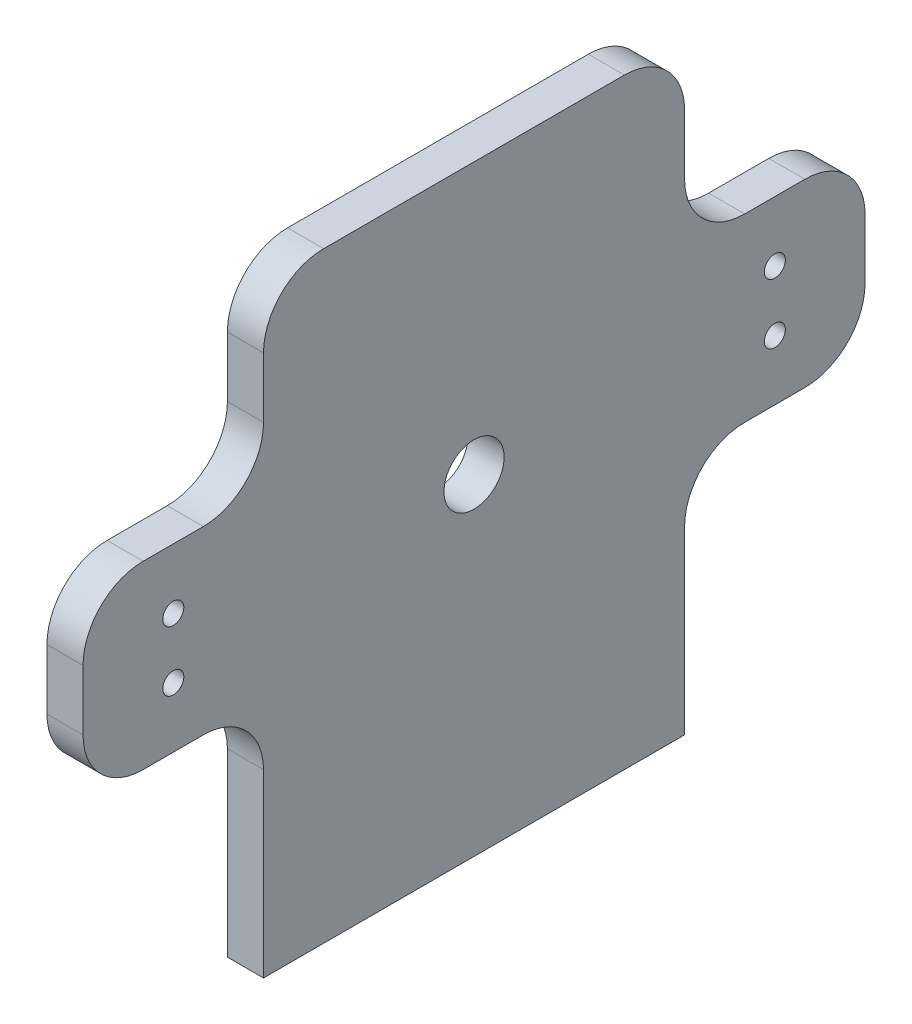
ISO-10303-21;
HEADER;
FILE_DESCRIPTION(('STEP AP214'),'2;1');
FILE_NAME('part.step','',(''),(''),'','','');
FILE_SCHEMA(('AUTOMOTIVE_DESIGN { 1 0 10303 214 1 1 1 1 }'));
ENDSEC;
DATA;
#1=APPLICATION_CONTEXT('core data for automotive mechanical design processes');
#2=APPLICATION_PROTOCOL_DEFINITION('international standard','automotive_design',2000,#1);
#3=PRODUCT_CONTEXT('',#1,'mechanical');
#4=PRODUCT('Part','Part','',(#3));
#5=PRODUCT_RELATED_PRODUCT_CATEGORY('part','',(#4));
#6=PRODUCT_DEFINITION_FORMATION('','',#4);
#7=PRODUCT_DEFINITION_CONTEXT('part definition',#1,'design');
#8=PRODUCT_DEFINITION('design','',#6,#7);
#9=PRODUCT_DEFINITION_SHAPE('','',#8);
#10=(LENGTH_UNIT() NAMED_UNIT(*) SI_UNIT(.MILLI.,.METRE.));
#11=(NAMED_UNIT(*) PLANE_ANGLE_UNIT() SI_UNIT($,.RADIAN.));
#12=(NAMED_UNIT(*) SI_UNIT($,.STERADIAN.) SOLID_ANGLE_UNIT());
#13=UNCERTAINTY_MEASURE_WITH_UNIT(LENGTH_MEASURE(1.E-05),#10,'distance_accuracy_value','');
#14=(GEOMETRIC_REPRESENTATION_CONTEXT(3) GLOBAL_UNCERTAINTY_ASSIGNED_CONTEXT((#13)) GLOBAL_UNIT_ASSIGNED_CONTEXT((#10,
#11,#12)) REPRESENTATION_CONTEXT('',''));
#15=CARTESIAN_POINT('',(0.,0.,0.));
#16=DIRECTION('',(0.,0.,1.));
#17=DIRECTION('',(1.,0.,0.));
#18=AXIS2_PLACEMENT_3D('',#15,#16,#17);
#19=CARTESIAN_POINT('',(6.,0.,0.));
#20=DIRECTION('',(0.,0.,-1.));
#21=DIRECTION('',(-1.,0.,0.));
#22=AXIS2_PLACEMENT_3D('',#19,#20,#21);
#23=PLANE('',#22);
#24=DIRECTION('',(0.,-1.,0.));
#25=VECTOR('',#24,1.);
#26=CARTESIAN_POINT('',(6.,0.,0.));
#27=LINE('',#26,#25);
#28=CARTESIAN_POINT('',(6.,30.,0.));
#29=VERTEX_POINT('',#28);
#30=CARTESIAN_POINT('',(6.,0.,0.));
#31=VERTEX_POINT('',#30);
#32=EDGE_CURVE('E214',#29,#31,#27,.T.);
#33=ORIENTED_EDGE('',*,*,#32,.F.);
#34=DIRECTION('',(-1.,0.,0.));
#35=VECTOR('',#34,1.);
#36=CARTESIAN_POINT('',(0.,30.,0.));
#37=LINE('',#36,#35);
#38=CARTESIAN_POINT('',(0.,30.,0.));
#39=VERTEX_POINT('',#38);
#40=EDGE_CURVE('E291',#29,#39,#37,.T.);
#41=ORIENTED_EDGE('',*,*,#40,.T.);
#42=DIRECTION('',(0.,-1.,0.));
#43=VECTOR('',#42,1.);
#44=CARTESIAN_POINT('',(0.,0.,0.));
#45=LINE('',#44,#43);
#46=CARTESIAN_POINT('',(0.,0.,0.));
#47=VERTEX_POINT('',#46);
#48=EDGE_CURVE('E213',#39,#47,#45,.T.);
#49=ORIENTED_EDGE('',*,*,#48,.T.);
#50=DIRECTION('',(-1.,0.,0.));
#51=VECTOR('',#50,1.);
#52=CARTESIAN_POINT('',(6.,0.,0.));
#53=LINE('',#52,#51);
#54=EDGE_CURVE('E281',#31,#47,#53,.T.);
#55=ORIENTED_EDGE('',*,*,#54,.F.);
#56=EDGE_LOOP('',(#33,#41,#49,#55));
#57=FACE_BOUND('',#56,.T.);
#58=ADVANCED_FACE('F30',(#57),#23,.F.);
#59=CARTESIAN_POINT('',(6.,0.,0.));
#60=DIRECTION('',(0.,1.,0.));
#61=DIRECTION('',(0.,0.,1.));
#62=AXIS2_PLACEMENT_3D('',#59,#60,#61);
#63=PLANE('',#62);
#64=CARTESIAN_POINT('',(3.,0.,-20.));
#65=DIRECTION('',(0.,-1.,0.));
#66=DIRECTION('',(0.,0.,-1.));
#67=AXIS2_PLACEMENT_3D('',#64,#65,#66);
#68=CIRCLE('',#67,1.5);
#69=CARTESIAN_POINT('',(3.,0.,-21.5));
#70=VERTEX_POINT('',#69);
#71=EDGE_CURVE('E785',#70,#70,#68,.T.);
#72=ORIENTED_EDGE('',*,*,#71,.F.);
#73=EDGE_LOOP('',(#72));
#74=FACE_BOUND('',#73,.T.);
#75=CARTESIAN_POINT('',(3.00000000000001,0.,-50.));
#76=DIRECTION('',(0.,-1.,0.));
#77=DIRECTION('',(0.,0.,-1.));
#78=AXIS2_PLACEMENT_3D('',#75,#76,#77);
#79=CIRCLE('',#78,1.5);
#80=CARTESIAN_POINT('',(3.00000000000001,0.,-51.5));
#81=VERTEX_POINT('',#80);
#82=EDGE_CURVE('E194',#81,#81,#79,.T.);
#83=ORIENTED_EDGE('',*,*,#82,.F.);
#84=EDGE_LOOP('',(#83));
#85=FACE_BOUND('',#84,.T.);
#86=DIRECTION('',(0.,0.,-1.));
#87=VECTOR('',#86,1.);
#88=CARTESIAN_POINT('',(0.,0.,0.));
#89=LINE('',#88,#87);
#90=CARTESIAN_POINT('',(0.,0.,-70.));
#91=VERTEX_POINT('',#90);
#92=EDGE_CURVE('E249',#47,#91,#89,.T.);
#93=ORIENTED_EDGE('',*,*,#92,.T.);
#94=DIRECTION('',(-1.,0.,0.));
#95=VECTOR('',#94,1.);
#96=CARTESIAN_POINT('',(6.,0.,-70.));
#97=LINE('',#96,#95);
#98=CARTESIAN_POINT('',(6.,0.,-70.));
#99=VERTEX_POINT('',#98);
#100=EDGE_CURVE('E247',#99,#91,#97,.T.);
#101=ORIENTED_EDGE('',*,*,#100,.F.);
#102=DIRECTION('',(0.,0.,-1.));
#103=VECTOR('',#102,1.);
#104=CARTESIAN_POINT('',(6.,0.,0.));
#105=LINE('',#104,#103);
#106=EDGE_CURVE('E216',#31,#99,#105,.T.);
#107=ORIENTED_EDGE('',*,*,#106,.F.);
#108=ORIENTED_EDGE('',*,*,#54,.T.);
#109=EDGE_LOOP('',(#93,#101,#107,#108));
#110=FACE_BOUND('',#109,.T.);
#111=ADVANCED_FACE('F413',(#74,#85,#110),#63,.F.);
#112=CARTESIAN_POINT('',(6.,0.,-70.));
#113=DIRECTION('',(0.,0.,1.));
#114=DIRECTION('',(1.,0.,0.));
#115=AXIS2_PLACEMENT_3D('',#112,#113,#114);
#116=PLANE('',#115);
#117=DIRECTION('',(0.,1.,0.));
#118=VECTOR('',#117,1.);
#119=CARTESIAN_POINT('',(0.,0.,-70.));
#120=LINE('',#119,#118);
#121=CARTESIAN_POINT('',(0.,30.,-70.));
#122=VERTEX_POINT('',#121);
#123=EDGE_CURVE('E251',#91,#122,#120,.T.);
#124=ORIENTED_EDGE('',*,*,#123,.T.);
#125=DIRECTION('',(-1.,0.,0.));
#126=VECTOR('',#125,1.);
#127=CARTESIAN_POINT('',(6.,30.,-70.));
#128=LINE('',#127,#126);
#129=CARTESIAN_POINT('',(6.,30.,-70.));
#130=VERTEX_POINT('',#129);
#131=EDGE_CURVE('E289',#122,#130,#128,.F.);
#132=ORIENTED_EDGE('',*,*,#131,.T.);
#133=DIRECTION('',(0.,1.,0.));
#134=VECTOR('',#133,1.);
#135=CARTESIAN_POINT('',(6.,0.,-70.));
#136=LINE('',#135,#134);
#137=EDGE_CURVE('E219',#99,#130,#136,.T.);
#138=ORIENTED_EDGE('',*,*,#137,.F.);
#139=ORIENTED_EDGE('',*,*,#100,.T.);
#140=EDGE_LOOP('',(#124,#132,#138,#139));
#141=FACE_BOUND('',#140,.T.);
#142=ADVANCED_FACE('F474',(#141),#116,.F.);
#143=CARTESIAN_POINT('',(6.,40.,-70.));
#144=DIRECTION('',(0.,1.,0.));
#145=DIRECTION('',(0.,0.,1.));
#146=AXIS2_PLACEMENT_3D('',#143,#144,#145);
#147=PLANE('',#146);
#148=DIRECTION('',(0.,0.,-1.));
#149=VECTOR('',#148,1.);
#150=CARTESIAN_POINT('',(6.,40.,-70.));
#151=LINE('',#150,#149);
#152=CARTESIAN_POINT('',(6.,40.,-80.));
#153=VERTEX_POINT('',#152);
#154=CARTESIAN_POINT('',(6.,40.,-90.));
#155=VERTEX_POINT('',#154);
#156=EDGE_CURVE('E222',#153,#155,#151,.T.);
#157=ORIENTED_EDGE('',*,*,#156,.F.);
#158=DIRECTION('',(-1.,0.,0.));
#159=VECTOR('',#158,1.);
#160=CARTESIAN_POINT('',(0.,40.,-80.));
#161=LINE('',#160,#159);
#162=CARTESIAN_POINT('',(0.,40.,-80.));
#163=VERTEX_POINT('',#162);
#164=EDGE_CURVE('E286',#153,#163,#161,.T.);
#165=ORIENTED_EDGE('',*,*,#164,.T.);
#166=DIRECTION('',(0.,0.,-1.));
#167=VECTOR('',#166,1.);
#168=CARTESIAN_POINT('',(0.,40.,-70.));
#169=LINE('',#168,#167);
#170=CARTESIAN_POINT('',(0.,40.,-90.));
#171=VERTEX_POINT('',#170);
#172=EDGE_CURVE('E254',#163,#171,#169,.T.);
#173=ORIENTED_EDGE('',*,*,#172,.T.);
#174=DIRECTION('',(-1.,0.,0.));
#175=VECTOR('',#174,1.);
#176=CARTESIAN_POINT('',(6.,40.,-90.));
#177=LINE('',#176,#175);
#178=EDGE_CURVE('E284',#171,#155,#177,.F.);
#179=ORIENTED_EDGE('',*,*,#178,.T.);
#180=EDGE_LOOP('',(#157,#165,#173,#179));
#181=FACE_BOUND('',#180,.T.);
#182=ADVANCED_FACE('F424',(#181),#147,.F.);
#183=CARTESIAN_POINT('',(6.,70.,-100.));
#184=DIRECTION('',(0.,0.,1.));
#185=DIRECTION('',(1.,0.,0.));
#186=AXIS2_PLACEMENT_3D('',#183,#184,#185);
#187=PLANE('',#186);
#188=DIRECTION('',(0.,1.,0.));
#189=VECTOR('',#188,1.);
#190=CARTESIAN_POINT('',(6.,70.,-100.));
#191=LINE('',#190,#189);
#192=CARTESIAN_POINT('',(6.,50.,-100.));
#193=VERTEX_POINT('',#192);
#194=CARTESIAN_POINT('',(6.,60.,-100.));
#195=VERTEX_POINT('',#194);
#196=EDGE_CURVE('E225',#193,#195,#191,.T.);
#197=ORIENTED_EDGE('',*,*,#196,.F.);
#198=DIRECTION('',(-1.,0.,0.));
#199=VECTOR('',#198,1.);
#200=CARTESIAN_POINT('',(6.,50.,-100.));
#201=LINE('',#200,#199);
#202=CARTESIAN_POINT('',(0.,50.,-100.));
#203=VERTEX_POINT('',#202);
#204=EDGE_CURVE('E321',#193,#203,#201,.T.);
#205=ORIENTED_EDGE('',*,*,#204,.T.);
#206=DIRECTION('',(0.,1.,0.));
#207=VECTOR('',#206,1.);
#208=CARTESIAN_POINT('',(0.,70.,-100.));
#209=LINE('',#208,#207);
#210=CARTESIAN_POINT('',(0.,60.,-100.));
#211=VERTEX_POINT('',#210);
#212=EDGE_CURVE('E257',#203,#211,#209,.T.);
#213=ORIENTED_EDGE('',*,*,#212,.T.);
#214=DIRECTION('',(-1.,0.,0.));
#215=VECTOR('',#214,1.);
#216=CARTESIAN_POINT('',(6.,60.,-100.));
#217=LINE('',#216,#215);
#218=EDGE_CURVE('E319',#211,#195,#217,.F.);
#219=ORIENTED_EDGE('',*,*,#218,.T.);
#220=EDGE_LOOP('',(#197,#205,#213,#219));
#221=FACE_BOUND('',#220,.T.);
#222=ADVANCED_FACE('F432',(#221),#187,.F.);
#223=CARTESIAN_POINT('',(6.,70.,-70.));
#224=DIRECTION('',(0.,-1.,0.));
#225=DIRECTION('',(0.,0.,-1.));
#226=AXIS2_PLACEMENT_3D('',#223,#224,#225);
#227=PLANE('',#226);
#228=DIRECTION('',(0.,0.,1.));
#229=VECTOR('',#228,1.);
#230=CARTESIAN_POINT('',(0.,70.,-70.));
#231=LINE('',#230,#229);
#232=CARTESIAN_POINT('',(0.,70.,-90.));
#233=VERTEX_POINT('',#232);
#234=CARTESIAN_POINT('',(0.,70.,-80.));
#235=VERTEX_POINT('',#234);
#236=EDGE_CURVE('E260',#233,#235,#231,.T.);
#237=ORIENTED_EDGE('',*,*,#236,.T.);
#238=DIRECTION('',(-1.,0.,0.));
#239=VECTOR('',#238,1.);
#240=CARTESIAN_POINT('',(6.,70.,-80.));
#241=LINE('',#240,#239);
#242=CARTESIAN_POINT('',(6.,70.,-80.));
#243=VERTEX_POINT('',#242);
#244=EDGE_CURVE('E307',#235,#243,#241,.F.);
#245=ORIENTED_EDGE('',*,*,#244,.T.);
#246=DIRECTION('',(0.,0.,1.));
#247=VECTOR('',#246,1.);
#248=CARTESIAN_POINT('',(6.,70.,-70.));
#249=LINE('',#248,#247);
#250=CARTESIAN_POINT('',(6.,70.,-90.));
#251=VERTEX_POINT('',#250);
#252=EDGE_CURVE('E228',#251,#243,#249,.T.);
#253=ORIENTED_EDGE('',*,*,#252,.F.);
#254=DIRECTION('',(-1.,0.,0.));
#255=VECTOR('',#254,1.);
#256=CARTESIAN_POINT('',(6.,70.,-90.));
#257=LINE('',#256,#255);
#258=EDGE_CURVE('E304',#251,#233,#257,.T.);
#259=ORIENTED_EDGE('',*,*,#258,.T.);
#260=EDGE_LOOP('',(#237,#245,#253,#259));
#261=FACE_BOUND('',#260,.T.);
#262=ADVANCED_FACE('F441',(#261),#227,.F.);
#263=CARTESIAN_POINT('',(6.,70.,-70.));
#264=DIRECTION('',(0.,0.,1.));
#265=DIRECTION('',(1.,0.,0.));
#266=AXIS2_PLACEMENT_3D('',#263,#264,#265);
#267=PLANE('',#266);
#268=DIRECTION('',(0.,1.,0.));
#269=VECTOR('',#268,1.);
#270=CARTESIAN_POINT('',(6.,70.,-70.));
#271=LINE('',#270,#269);
#272=CARTESIAN_POINT('',(6.,80.,-70.));
#273=VERTEX_POINT('',#272);
#274=CARTESIAN_POINT('',(6.,90.,-70.));
#275=VERTEX_POINT('',#274);
#276=EDGE_CURVE('E231',#273,#275,#271,.T.);
#277=ORIENTED_EDGE('',*,*,#276,.F.);
#278=DIRECTION('',(-1.,0.,0.));
#279=VECTOR('',#278,1.);
#280=CARTESIAN_POINT('',(0.,80.,-70.));
#281=LINE('',#280,#279);
#282=CARTESIAN_POINT('',(0.,80.,-70.));
#283=VERTEX_POINT('',#282);
#284=EDGE_CURVE('E301',#273,#283,#281,.T.);
#285=ORIENTED_EDGE('',*,*,#284,.T.);
#286=DIRECTION('',(0.,1.,0.));
#287=VECTOR('',#286,1.);
#288=CARTESIAN_POINT('',(0.,70.,-70.));
#289=LINE('',#288,#287);
#290=CARTESIAN_POINT('',(0.,90.,-70.));
#291=VERTEX_POINT('',#290);
#292=EDGE_CURVE('E263',#283,#291,#289,.T.);
#293=ORIENTED_EDGE('',*,*,#292,.T.);
#294=DIRECTION('',(-1.,0.,0.));
#295=VECTOR('',#294,1.);
#296=CARTESIAN_POINT('',(6.,90.,-70.));
#297=LINE('',#296,#295);
#298=EDGE_CURVE('E299',#291,#275,#297,.F.);
#299=ORIENTED_EDGE('',*,*,#298,.T.);
#300=EDGE_LOOP('',(#277,#285,#293,#299));
#301=FACE_BOUND('',#300,.T.);
#302=ADVANCED_FACE('F450',(#301),#267,.F.);
#303=CARTESIAN_POINT('',(6.,100.,0.));
#304=DIRECTION('',(0.,-1.,0.));
#305=DIRECTION('',(0.,0.,-1.));
#306=AXIS2_PLACEMENT_3D('',#303,#304,#305);
#307=PLANE('',#306);
#308=DIRECTION('',(0.,0.,1.));
#309=VECTOR('',#308,1.);
#310=CARTESIAN_POINT('',(6.,100.,0.));
#311=LINE('',#310,#309);
#312=CARTESIAN_POINT('',(6.,100.,-60.));
#313=VERTEX_POINT('',#312);
#314=CARTESIAN_POINT('',(6.,100.,-10.));
#315=VERTEX_POINT('',#314);
#316=EDGE_CURVE('E234',#313,#315,#311,.T.);
#317=ORIENTED_EDGE('',*,*,#316,.F.);
#318=DIRECTION('',(-1.,0.,0.));
#319=VECTOR('',#318,1.);
#320=CARTESIAN_POINT('',(6.,100.,-60.));
#321=LINE('',#320,#319);
#322=CARTESIAN_POINT('',(0.,100.,-60.));
#323=VERTEX_POINT('',#322);
#324=EDGE_CURVE('E353',#313,#323,#321,.T.);
#325=ORIENTED_EDGE('',*,*,#324,.T.);
#326=DIRECTION('',(0.,0.,1.));
#327=VECTOR('',#326,1.);
#328=CARTESIAN_POINT('',(0.,100.,0.));
#329=LINE('',#328,#327);
#330=CARTESIAN_POINT('',(0.,100.,-10.));
#331=VERTEX_POINT('',#330);
#332=EDGE_CURVE('E266',#323,#331,#329,.T.);
#333=ORIENTED_EDGE('',*,*,#332,.T.);
#334=DIRECTION('',(-1.,0.,0.));
#335=VECTOR('',#334,1.);
#336=CARTESIAN_POINT('',(6.,100.,-10.));
#337=LINE('',#336,#335);
#338=EDGE_CURVE('E351',#331,#315,#337,.F.);
#339=ORIENTED_EDGE('',*,*,#338,.T.);
#340=EDGE_LOOP('',(#317,#325,#333,#339));
#341=FACE_BOUND('',#340,.T.);
#342=ADVANCED_FACE('F459',(#341),#307,.F.);
#343=CARTESIAN_POINT('',(6.,70.,0.));
#344=DIRECTION('',(0.,0.,-1.));
#345=DIRECTION('',(-1.,0.,0.));
#346=AXIS2_PLACEMENT_3D('',#343,#344,#345);
#347=PLANE('',#346);
#348=DIRECTION('',(0.,-1.,0.));
#349=VECTOR('',#348,1.);
#350=CARTESIAN_POINT('',(0.,70.,0.));
#351=LINE('',#350,#349);
#352=CARTESIAN_POINT('',(0.,90.,0.));
#353=VERTEX_POINT('',#352);
#354=CARTESIAN_POINT('',(0.,80.,0.));
#355=VERTEX_POINT('',#354);
#356=EDGE_CURVE('E269',#353,#355,#351,.T.);
#357=ORIENTED_EDGE('',*,*,#356,.T.);
#358=DIRECTION('',(-1.,0.,0.));
#359=VECTOR('',#358,1.);
#360=CARTESIAN_POINT('',(6.,80.,0.));
#361=LINE('',#360,#359);
#362=CARTESIAN_POINT('',(6.,80.,0.));
#363=VERTEX_POINT('',#362);
#364=EDGE_CURVE('E317',#355,#363,#361,.F.);
#365=ORIENTED_EDGE('',*,*,#364,.T.);
#366=DIRECTION('',(0.,-1.,0.));
#367=VECTOR('',#366,1.);
#368=CARTESIAN_POINT('',(6.,70.,0.));
#369=LINE('',#368,#367);
#370=CARTESIAN_POINT('',(6.,90.,0.));
#371=VERTEX_POINT('',#370);
#372=EDGE_CURVE('E237',#371,#363,#369,.T.);
#373=ORIENTED_EDGE('',*,*,#372,.F.);
#374=DIRECTION('',(-1.,0.,0.));
#375=VECTOR('',#374,1.);
#376=CARTESIAN_POINT('',(6.,90.,0.));
#377=LINE('',#376,#375);
#378=EDGE_CURVE('E314',#371,#353,#377,.T.);
#379=ORIENTED_EDGE('',*,*,#378,.T.);
#380=EDGE_LOOP('',(#357,#365,#373,#379));
#381=FACE_BOUND('',#380,.T.);
#382=ADVANCED_FACE('F376',(#381),#347,.F.);
#383=CARTESIAN_POINT('',(6.,70.,0.));
#384=DIRECTION('',(0.,-1.,0.));
#385=DIRECTION('',(0.,0.,-1.));
#386=AXIS2_PLACEMENT_3D('',#383,#384,#385);
#387=PLANE('',#386);
#388=DIRECTION('',(0.,0.,1.));
#389=VECTOR('',#388,1.);
#390=CARTESIAN_POINT('',(6.,70.,0.));
#391=LINE('',#390,#389);
#392=CARTESIAN_POINT('',(6.,70.,10.));
#393=VERTEX_POINT('',#392);
#394=CARTESIAN_POINT('',(6.,70.,20.));
#395=VERTEX_POINT('',#394);
#396=EDGE_CURVE('E240',#393,#395,#391,.T.);
#397=ORIENTED_EDGE('',*,*,#396,.F.);
#398=DIRECTION('',(-1.,0.,0.));
#399=VECTOR('',#398,1.);
#400=CARTESIAN_POINT('',(0.,70.,10.));
#401=LINE('',#400,#399);
#402=CARTESIAN_POINT('',(0.,70.,10.));
#403=VERTEX_POINT('',#402);
#404=EDGE_CURVE('E311',#393,#403,#401,.T.);
#405=ORIENTED_EDGE('',*,*,#404,.T.);
#406=DIRECTION('',(0.,0.,1.));
#407=VECTOR('',#406,1.);
#408=CARTESIAN_POINT('',(0.,70.,0.));
#409=LINE('',#408,#407);
#410=CARTESIAN_POINT('',(0.,70.,20.));
#411=VERTEX_POINT('',#410);
#412=EDGE_CURVE('E272',#403,#411,#409,.T.);
#413=ORIENTED_EDGE('',*,*,#412,.T.);
#414=DIRECTION('',(-1.,0.,0.));
#415=VECTOR('',#414,1.);
#416=CARTESIAN_POINT('',(6.,70.,20.));
#417=LINE('',#416,#415);
#418=EDGE_CURVE('E309',#411,#395,#417,.F.);
#419=ORIENTED_EDGE('',*,*,#418,.T.);
#420=EDGE_LOOP('',(#397,#405,#413,#419));
#421=FACE_BOUND('',#420,.T.);
#422=ADVANCED_FACE('F384',(#421),#387,.F.);
#423=CARTESIAN_POINT('',(6.,70.,30.));
#424=DIRECTION('',(0.,0.,-1.));
#425=DIRECTION('',(-1.,0.,0.));
#426=AXIS2_PLACEMENT_3D('',#423,#424,#425);
#427=PLANE('',#426);
#428=DIRECTION('',(0.,-1.,0.));
#429=VECTOR('',#428,1.);
#430=CARTESIAN_POINT('',(0.,70.,30.));
#431=LINE('',#430,#429);
#432=CARTESIAN_POINT('',(0.,60.,30.));
#433=VERTEX_POINT('',#432);
#434=CARTESIAN_POINT('',(0.,50.,30.));
#435=VERTEX_POINT('',#434);
#436=EDGE_CURVE('E275',#433,#435,#431,.T.);
#437=ORIENTED_EDGE('',*,*,#436,.T.);
#438=DIRECTION('',(-1.,0.,0.));
#439=VECTOR('',#438,1.);
#440=CARTESIAN_POINT('',(6.,50.,30.));
#441=LINE('',#440,#439);
#442=CARTESIAN_POINT('',(6.,50.,30.));
#443=VERTEX_POINT('',#442);
#444=EDGE_CURVE('E45',#435,#443,#441,.F.);
#445=ORIENTED_EDGE('',*,*,#444,.T.);
#446=DIRECTION('',(0.,-1.,0.));
#447=VECTOR('',#446,1.);
#448=CARTESIAN_POINT('',(6.,70.,30.));
#449=LINE('',#448,#447);
#450=CARTESIAN_POINT('',(6.,60.,30.));
#451=VERTEX_POINT('',#450);
#452=EDGE_CURVE('E242',#451,#443,#449,.T.);
#453=ORIENTED_EDGE('',*,*,#452,.F.);
#454=DIRECTION('',(-1.,0.,0.));
#455=VECTOR('',#454,1.);
#456=CARTESIAN_POINT('',(6.,60.,30.));
#457=LINE('',#456,#455);
#458=EDGE_CURVE('E347',#451,#433,#457,.T.);
#459=ORIENTED_EDGE('',*,*,#458,.T.);
#460=EDGE_LOOP('',(#437,#445,#453,#459));
#461=FACE_BOUND('',#460,.T.);
#462=ADVANCED_FACE('F390',(#461),#427,.F.);
#463=CARTESIAN_POINT('',(6.,40.,0.));
#464=DIRECTION('',(0.,1.,0.));
#465=DIRECTION('',(0.,0.,1.));
#466=AXIS2_PLACEMENT_3D('',#463,#464,#465);
#467=PLANE('',#466);
#468=DIRECTION('',(0.,0.,-1.));
#469=VECTOR('',#468,1.);
#470=CARTESIAN_POINT('',(0.,40.,0.));
#471=LINE('',#470,#469);
#472=CARTESIAN_POINT('',(0.,40.,20.));
#473=VERTEX_POINT('',#472);
#474=CARTESIAN_POINT('',(0.,40.,10.));
#475=VERTEX_POINT('',#474);
#476=EDGE_CURVE('E217',#473,#475,#471,.T.);
#477=ORIENTED_EDGE('',*,*,#476,.T.);
#478=DIRECTION('',(-1.,0.,0.));
#479=VECTOR('',#478,1.);
#480=CARTESIAN_POINT('',(6.,40.,10.));
#481=LINE('',#480,#479);
#482=CARTESIAN_POINT('',(6.,40.,10.));
#483=VERTEX_POINT('',#482);
#484=EDGE_CURVE('E297',#475,#483,#481,.F.);
#485=ORIENTED_EDGE('',*,*,#484,.T.);
#486=DIRECTION('',(0.,0.,-1.));
#487=VECTOR('',#486,1.);
#488=CARTESIAN_POINT('',(6.,40.,0.));
#489=LINE('',#488,#487);
#490=CARTESIAN_POINT('',(6.,40.,20.));
#491=VERTEX_POINT('',#490);
#492=EDGE_CURVE('E244',#491,#483,#489,.T.);
#493=ORIENTED_EDGE('',*,*,#492,.F.);
#494=DIRECTION('',(-1.,0.,0.));
#495=VECTOR('',#494,1.);
#496=CARTESIAN_POINT('',(6.,40.,20.));
#497=LINE('',#496,#495);
#498=EDGE_CURVE('E294',#491,#473,#497,.T.);
#499=ORIENTED_EDGE('',*,*,#498,.T.);
#500=EDGE_LOOP('',(#477,#485,#493,#499));
#501=FACE_BOUND('',#500,.T.);
#502=ADVANCED_FACE('F398',(#501),#467,.F.);
#503=CARTESIAN_POINT('',(6.,40.,0.));
#504=DIRECTION('',(1.,0.,0.));
#505=DIRECTION('',(0.,0.,-1.));
#506=AXIS2_PLACEMENT_3D('',#503,#504,#505);
#507=PLANE('',#506);
#508=CARTESIAN_POINT('',(6.,60.,15.));
#509=DIRECTION('',(1.,0.,0.));
#510=DIRECTION('',(0.,0.,1.));
#511=AXIS2_PLACEMENT_3D('',#508,#509,#510);
#512=CIRCLE('',#511,1.75);
#513=CARTESIAN_POINT('',(6.,60.,16.75));
#514=VERTEX_POINT('',#513);
#515=EDGE_CURVE('E764',#514,#514,#512,.T.);
#516=ORIENTED_EDGE('',*,*,#515,.F.);
#517=EDGE_LOOP('',(#516));
#518=FACE_BOUND('',#517,.T.);
#519=CARTESIAN_POINT('',(6.,50.,15.));
#520=DIRECTION('',(1.,0.,0.));
#521=DIRECTION('',(0.,0.,1.));
#522=AXIS2_PLACEMENT_3D('',#519,#520,#521);
#523=CIRCLE('',#522,1.75);
#524=CARTESIAN_POINT('',(6.,50.,16.75));
#525=VERTEX_POINT('',#524);
#526=EDGE_CURVE('E768',#525,#525,#523,.T.);
#527=ORIENTED_EDGE('',*,*,#526,.F.);
#528=EDGE_LOOP('',(#527));
#529=FACE_BOUND('',#528,.T.);
#530=CARTESIAN_POINT('',(6.,50.,-85.));
#531=DIRECTION('',(1.,0.,0.));
#532=DIRECTION('',(0.,0.,-1.));
#533=AXIS2_PLACEMENT_3D('',#530,#531,#532);
#534=CIRCLE('',#533,1.75);
#535=CARTESIAN_POINT('',(6.,50.,-86.75));
#536=VERTEX_POINT('',#535);
#537=EDGE_CURVE('E772',#536,#536,#534,.T.);
#538=ORIENTED_EDGE('',*,*,#537,.F.);
#539=EDGE_LOOP('',(#538));
#540=FACE_BOUND('',#539,.T.);
#541=CARTESIAN_POINT('',(6.,60.,-85.));
#542=DIRECTION('',(1.,0.,0.));
#543=DIRECTION('',(0.,0.,-1.));
#544=AXIS2_PLACEMENT_3D('',#541,#542,#543);
#545=CIRCLE('',#544,1.75);
#546=CARTESIAN_POINT('',(6.,60.,-86.75));
#547=VERTEX_POINT('',#546);
#548=EDGE_CURVE('E776',#547,#547,#545,.T.);
#549=ORIENTED_EDGE('',*,*,#548,.F.);
#550=EDGE_LOOP('',(#549));
#551=FACE_BOUND('',#550,.T.);
#552=CARTESIAN_POINT('',(6.,55.,-35.));
#553=DIRECTION('',(1.,0.,0.));
#554=DIRECTION('',(0.,0.,-1.));
#555=AXIS2_PLACEMENT_3D('',#552,#553,#554);
#556=CIRCLE('',#555,5.);
#557=CARTESIAN_POINT('',(6.,55.,-40.));
#558=VERTEX_POINT('',#557);
#559=EDGE_CURVE('E779',#558,#558,#556,.T.);
#560=ORIENTED_EDGE('',*,*,#559,.F.);
#561=EDGE_LOOP('',(#560));
#562=FACE_BOUND('',#561,.T.);
#563=ORIENTED_EDGE('',*,*,#156,.T.);
#564=CARTESIAN_POINT('',(6.,50.,-90.));
#565=DIRECTION('',(1.,0.,0.));
#566=DIRECTION('',(0.,0.,-1.));
#567=AXIS2_PLACEMENT_3D('',#564,#565,#566);
#568=CIRCLE('',#567,10.);
#569=EDGE_CURVE('E345',#155,#193,#568,.T.);
#570=ORIENTED_EDGE('',*,*,#569,.T.);
#571=ORIENTED_EDGE('',*,*,#196,.T.);
#572=CARTESIAN_POINT('',(6.,60.,-90.));
#573=DIRECTION('',(1.,0.,0.));
#574=DIRECTION('',(0.,0.,-1.));
#575=AXIS2_PLACEMENT_3D('',#572,#573,#574);
#576=CIRCLE('',#575,10.);
#577=EDGE_CURVE('E343',#195,#251,#576,.T.);
#578=ORIENTED_EDGE('',*,*,#577,.T.);
#579=ORIENTED_EDGE('',*,*,#252,.T.);
#580=CARTESIAN_POINT('',(6.,80.,-80.));
#581=DIRECTION('',(1.,0.,0.));
#582=DIRECTION('',(0.,0.,-1.));
#583=AXIS2_PLACEMENT_3D('',#580,#581,#582);
#584=CIRCLE('',#583,10.);
#585=EDGE_CURVE('E366',#243,#273,#584,.F.);
#586=ORIENTED_EDGE('',*,*,#585,.T.);
#587=ORIENTED_EDGE('',*,*,#276,.T.);
#588=CARTESIAN_POINT('',(6.,90.,-60.));
#589=DIRECTION('',(1.,0.,0.));
#590=DIRECTION('',(0.,0.,-1.));
#591=AXIS2_PLACEMENT_3D('',#588,#589,#590);
#592=CIRCLE('',#591,10.);
#593=EDGE_CURVE('E338',#275,#313,#592,.T.);
#594=ORIENTED_EDGE('',*,*,#593,.T.);
#595=ORIENTED_EDGE('',*,*,#316,.T.);
#596=CARTESIAN_POINT('',(6.,90.,-10.));
#597=DIRECTION('',(1.,0.,0.));
#598=DIRECTION('',(0.,0.,-1.));
#599=AXIS2_PLACEMENT_3D('',#596,#597,#598);
#600=CIRCLE('',#599,10.);
#601=EDGE_CURVE('E336',#315,#371,#600,.T.);
#602=ORIENTED_EDGE('',*,*,#601,.T.);
#603=ORIENTED_EDGE('',*,*,#372,.T.);
#604=CARTESIAN_POINT('',(6.,80.,10.));
#605=DIRECTION('',(1.,0.,0.));
#606=DIRECTION('',(0.,0.,-1.));
#607=AXIS2_PLACEMENT_3D('',#604,#605,#606);
#608=CIRCLE('',#607,10.);
#609=EDGE_CURVE('E11',#363,#393,#608,.F.);
#610=ORIENTED_EDGE('',*,*,#609,.T.);
#611=ORIENTED_EDGE('',*,*,#396,.T.);
#612=CARTESIAN_POINT('',(6.,60.,20.));
#613=DIRECTION('',(1.,0.,0.));
#614=DIRECTION('',(0.,0.,-1.));
#615=AXIS2_PLACEMENT_3D('',#612,#613,#614);
#616=CIRCLE('',#615,10.);
#617=EDGE_CURVE('E52',#395,#451,#616,.T.);
#618=ORIENTED_EDGE('',*,*,#617,.T.);
#619=ORIENTED_EDGE('',*,*,#452,.T.);
#620=CARTESIAN_POINT('',(6.,50.,20.));
#621=DIRECTION('',(1.,0.,0.));
#622=DIRECTION('',(0.,0.,-1.));
#623=AXIS2_PLACEMENT_3D('',#620,#621,#622);
#624=CIRCLE('',#623,10.);
#625=EDGE_CURVE('E341',#443,#491,#624,.T.);
#626=ORIENTED_EDGE('',*,*,#625,.T.);
#627=ORIENTED_EDGE('',*,*,#492,.T.);
#628=CARTESIAN_POINT('',(6.,30.,10.));
#629=DIRECTION('',(1.,0.,0.));
#630=DIRECTION('',(0.,0.,-1.));
#631=AXIS2_PLACEMENT_3D('',#628,#629,#630);
#632=CIRCLE('',#631,10.);
#633=EDGE_CURVE('E362',#483,#29,#632,.F.);
#634=ORIENTED_EDGE('',*,*,#633,.T.);
#635=ORIENTED_EDGE('',*,*,#32,.T.);
#636=ORIENTED_EDGE('',*,*,#106,.T.);
#637=ORIENTED_EDGE('',*,*,#137,.T.);
#638=CARTESIAN_POINT('',(6.,30.,-80.));
#639=DIRECTION('',(1.,0.,0.));
#640=DIRECTION('',(0.,0.,-1.));
#641=AXIS2_PLACEMENT_3D('',#638,#639,#640);
#642=CIRCLE('',#641,10.);
#643=EDGE_CURVE('E358',#130,#153,#642,.F.);
#644=ORIENTED_EDGE('',*,*,#643,.T.);
#645=EDGE_LOOP('',(#563,#570,#571,#578,#579,#586,#587,#594,#595,#602,#603,#610,#611,#618,#619,
#626,#627,#634,#635,#636,#637,#644));
#646=FACE_BOUND('',#645,.T.);
#647=ADVANCED_FACE('F382',(#518,#529,#540,#551,#562,#646),#507,.T.);
#648=CARTESIAN_POINT('',(0.,40.,0.));
#649=DIRECTION('',(1.,0.,0.));
#650=DIRECTION('',(0.,0.,-1.));
#651=AXIS2_PLACEMENT_3D('',#648,#649,#650);
#652=PLANE('',#651);
#653=CARTESIAN_POINT('',(0.,60.,15.));
#654=DIRECTION('',(1.,0.,0.));
#655=DIRECTION('',(0.,0.,1.));
#656=AXIS2_PLACEMENT_3D('',#653,#654,#655);
#657=CIRCLE('',#656,1.75);
#658=CARTESIAN_POINT('',(0.,60.,16.75));
#659=VERTEX_POINT('',#658);
#660=EDGE_CURVE('E807',#659,#659,#657,.T.);
#661=ORIENTED_EDGE('',*,*,#660,.T.);
#662=EDGE_LOOP('',(#661));
#663=FACE_BOUND('',#662,.T.);
#664=CARTESIAN_POINT('',(0.,50.,15.));
#665=DIRECTION('',(1.,0.,0.));
#666=DIRECTION('',(0.,0.,1.));
#667=AXIS2_PLACEMENT_3D('',#664,#665,#666);
#668=CIRCLE('',#667,1.75);
#669=CARTESIAN_POINT('',(0.,50.,16.75));
#670=VERTEX_POINT('',#669);
#671=EDGE_CURVE('E803',#670,#670,#668,.T.);
#672=ORIENTED_EDGE('',*,*,#671,.T.);
#673=EDGE_LOOP('',(#672));
#674=FACE_BOUND('',#673,.T.);
#675=CARTESIAN_POINT('',(0.,50.,-85.));
#676=DIRECTION('',(1.,0.,0.));
#677=DIRECTION('',(0.,0.,-1.));
#678=AXIS2_PLACEMENT_3D('',#675,#676,#677);
#679=CIRCLE('',#678,1.75);
#680=CARTESIAN_POINT('',(0.,50.,-86.75));
#681=VERTEX_POINT('',#680);
#682=EDGE_CURVE('E800',#681,#681,#679,.T.);
#683=ORIENTED_EDGE('',*,*,#682,.T.);
#684=EDGE_LOOP('',(#683));
#685=FACE_BOUND('',#684,.T.);
#686=CARTESIAN_POINT('',(0.,60.,-85.));
#687=DIRECTION('',(1.,0.,0.));
#688=DIRECTION('',(0.,0.,-1.));
#689=AXIS2_PLACEMENT_3D('',#686,#687,#688);
#690=CIRCLE('',#689,1.75);
#691=CARTESIAN_POINT('',(0.,60.,-86.75));
#692=VERTEX_POINT('',#691);
#693=EDGE_CURVE('E782',#692,#692,#690,.T.);
#694=ORIENTED_EDGE('',*,*,#693,.T.);
#695=EDGE_LOOP('',(#694));
#696=FACE_BOUND('',#695,.T.);
#697=CARTESIAN_POINT('',(0.,55.,-35.));
#698=DIRECTION('',(1.,0.,0.));
#699=DIRECTION('',(0.,0.,-1.));
#700=AXIS2_PLACEMENT_3D('',#697,#698,#699);
#701=CIRCLE('',#700,5.);
#702=CARTESIAN_POINT('',(0.,55.,-40.));
#703=VERTEX_POINT('',#702);
#704=EDGE_CURVE('E781',#703,#703,#701,.T.);
#705=ORIENTED_EDGE('',*,*,#704,.T.);
#706=EDGE_LOOP('',(#705));
#707=FACE_BOUND('',#706,.T.);
#708=ORIENTED_EDGE('',*,*,#212,.F.);
#709=CARTESIAN_POINT('',(0.,50.,-90.));
#710=DIRECTION('',(1.,0.,0.));
#711=DIRECTION('',(0.,0.,-1.));
#712=AXIS2_PLACEMENT_3D('',#709,#710,#711);
#713=CIRCLE('',#712,10.);
#714=EDGE_CURVE('E334',#203,#171,#713,.F.);
#715=ORIENTED_EDGE('',*,*,#714,.T.);
#716=ORIENTED_EDGE('',*,*,#172,.F.);
#717=CARTESIAN_POINT('',(0.,30.,-80.));
#718=DIRECTION('',(1.,0.,0.));
#719=DIRECTION('',(0.,0.,-1.));
#720=AXIS2_PLACEMENT_3D('',#717,#718,#719);
#721=CIRCLE('',#720,10.);
#722=EDGE_CURVE('E356',#163,#122,#721,.T.);
#723=ORIENTED_EDGE('',*,*,#722,.T.);
#724=ORIENTED_EDGE('',*,*,#123,.F.);
#725=ORIENTED_EDGE('',*,*,#92,.F.);
#726=ORIENTED_EDGE('',*,*,#48,.F.);
#727=CARTESIAN_POINT('',(0.,30.,10.));
#728=DIRECTION('',(1.,0.,0.));
#729=DIRECTION('',(0.,0.,-1.));
#730=AXIS2_PLACEMENT_3D('',#727,#728,#729);
#731=CIRCLE('',#730,10.);
#732=EDGE_CURVE('E360',#39,#475,#731,.T.);
#733=ORIENTED_EDGE('',*,*,#732,.T.);
#734=ORIENTED_EDGE('',*,*,#476,.F.);
#735=CARTESIAN_POINT('',(0.,50.,20.));
#736=DIRECTION('',(1.,0.,0.));
#737=DIRECTION('',(0.,0.,-1.));
#738=AXIS2_PLACEMENT_3D('',#735,#736,#737);
#739=CIRCLE('',#738,10.);
#740=EDGE_CURVE('E330',#473,#435,#739,.F.);
#741=ORIENTED_EDGE('',*,*,#740,.T.);
#742=ORIENTED_EDGE('',*,*,#436,.F.);
#743=CARTESIAN_POINT('',(0.,60.,20.));
#744=DIRECTION('',(1.,0.,0.));
#745=DIRECTION('',(0.,0.,-1.));
#746=AXIS2_PLACEMENT_3D('',#743,#744,#745);
#747=CIRCLE('',#746,10.);
#748=EDGE_CURVE('E328',#433,#411,#747,.F.);
#749=ORIENTED_EDGE('',*,*,#748,.T.);
#750=ORIENTED_EDGE('',*,*,#412,.F.);
#751=CARTESIAN_POINT('',(0.,80.,10.));
#752=DIRECTION('',(1.,0.,0.));
#753=DIRECTION('',(0.,0.,-1.));
#754=AXIS2_PLACEMENT_3D('',#751,#752,#753);
#755=CIRCLE('',#754,10.);
#756=EDGE_CURVE('E38',#403,#355,#755,.T.);
#757=ORIENTED_EDGE('',*,*,#756,.T.);
#758=ORIENTED_EDGE('',*,*,#356,.F.);
#759=CARTESIAN_POINT('',(0.,90.,-10.));
#760=DIRECTION('',(1.,0.,0.));
#761=DIRECTION('',(0.,0.,-1.));
#762=AXIS2_PLACEMENT_3D('',#759,#760,#761);
#763=CIRCLE('',#762,10.);
#764=EDGE_CURVE('E324',#353,#331,#763,.F.);
#765=ORIENTED_EDGE('',*,*,#764,.T.);
#766=ORIENTED_EDGE('',*,*,#332,.F.);
#767=CARTESIAN_POINT('',(0.,90.,-60.));
#768=DIRECTION('',(1.,0.,0.));
#769=DIRECTION('',(0.,0.,-1.));
#770=AXIS2_PLACEMENT_3D('',#767,#768,#769);
#771=CIRCLE('',#770,10.);
#772=EDGE_CURVE('E326',#323,#291,#771,.F.);
#773=ORIENTED_EDGE('',*,*,#772,.T.);
#774=ORIENTED_EDGE('',*,*,#292,.F.);
#775=CARTESIAN_POINT('',(0.,80.,-80.));
#776=DIRECTION('',(1.,0.,0.));
#777=DIRECTION('',(0.,0.,-1.));
#778=AXIS2_PLACEMENT_3D('',#775,#776,#777);
#779=CIRCLE('',#778,10.);
#780=EDGE_CURVE('E364',#283,#235,#779,.T.);
#781=ORIENTED_EDGE('',*,*,#780,.T.);
#782=ORIENTED_EDGE('',*,*,#236,.F.);
#783=CARTESIAN_POINT('',(0.,60.,-90.));
#784=DIRECTION('',(1.,0.,0.));
#785=DIRECTION('',(0.,0.,-1.));
#786=AXIS2_PLACEMENT_3D('',#783,#784,#785);
#787=CIRCLE('',#786,10.);
#788=EDGE_CURVE('E332',#233,#211,#787,.F.);
#789=ORIENTED_EDGE('',*,*,#788,.T.);
#790=EDGE_LOOP('',(#708,#715,#716,#723,#724,#725,#726,#733,#734,#741,#742,#749,#750,#757,#758,
#765,#766,#773,#774,#781,#782,#789));
#791=FACE_BOUND('',#790,.T.);
#792=ADVANCED_FACE('F371',(#663,#674,#685,#696,#707,#791),#652,.F.);
#793=CARTESIAN_POINT('',(3.00000000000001,10.,-50.));
#794=DIRECTION('',(0.,-1.,0.));
#795=DIRECTION('',(0.,0.,-1.));
#796=AXIS2_PLACEMENT_3D('',#793,#794,#795);
#797=CONICAL_SURFACE('',#796,1.25,1.02974425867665);
#798=CARTESIAN_POINT('',(3.,10.7510757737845,-50.));
#799=VERTEX_POINT('',#798);
#800=VERTEX_LOOP('',#799);
#801=FACE_BOUND('',#800,.T.);
#802=CARTESIAN_POINT('',(3.00000000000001,10.,-50.));
#803=DIRECTION('',(0.,-1.,0.));
#804=DIRECTION('',(0.,0.,-1.));
#805=AXIS2_PLACEMENT_3D('',#802,#803,#804);
#806=CIRCLE('',#805,1.25);
#807=CARTESIAN_POINT('',(3.00000000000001,10.,-51.25));
#808=VERTEX_POINT('',#807);
#809=EDGE_CURVE('E210',#808,#808,#806,.T.);
#810=ORIENTED_EDGE('',*,*,#809,.T.);
#811=EDGE_LOOP('',(#810));
#812=FACE_BOUND('',#811,.T.);
#813=ADVANCED_FACE('F645',(#801,#812),#797,.F.);
#814=CARTESIAN_POINT('',(3.00000000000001,0.,-50.));
#815=DIRECTION('',(0.,-1.,0.));
#816=DIRECTION('',(0.,0.,-1.));
#817=AXIS2_PLACEMENT_3D('',#814,#815,#816);
#818=CYLINDRICAL_SURFACE('',#817,1.25);
#819=ORIENTED_EDGE('',*,*,#809,.F.);
#820=EDGE_LOOP('',(#819));
#821=FACE_BOUND('',#820,.T.);
#822=CARTESIAN_POINT('',(3.00000000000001,6.,-50.));
#823=DIRECTION('',(0.,-1.,0.));
#824=DIRECTION('',(0.,0.,-1.));
#825=AXIS2_PLACEMENT_3D('',#822,#823,#824);
#826=CIRCLE('',#825,1.25);
#827=CARTESIAN_POINT('',(3.00000000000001,6.,-51.25));
#828=VERTEX_POINT('',#827);
#829=EDGE_CURVE('E207',#828,#828,#826,.T.);
#830=ORIENTED_EDGE('',*,*,#829,.T.);
#831=EDGE_LOOP('',(#830));
#832=FACE_BOUND('',#831,.T.);
#833=ADVANCED_FACE('F636',(#821,#832),#818,.F.);
#834=CARTESIAN_POINT('',(4.25,6.,-50.));
#835=DIRECTION('',(0.,1.,0.));
#836=DIRECTION('',(0.,0.,1.));
#837=AXIS2_PLACEMENT_3D('',#834,#835,#836);
#838=PLANE('',#837);
#839=ORIENTED_EDGE('',*,*,#829,.F.);
#840=EDGE_LOOP('',(#839));
#841=FACE_BOUND('',#840,.T.);
#842=CARTESIAN_POINT('',(3.00000000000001,6.,-50.));
#843=DIRECTION('',(0.,-1.,0.));
#844=DIRECTION('',(0.,0.,-1.));
#845=AXIS2_PLACEMENT_3D('',#842,#843,#844);
#846=CIRCLE('',#845,1.5);
#847=CARTESIAN_POINT('',(3.00000000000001,6.,-51.5));
#848=VERTEX_POINT('',#847);
#849=EDGE_CURVE('E198',#848,#848,#846,.T.);
#850=ORIENTED_EDGE('',*,*,#849,.T.);
#851=EDGE_LOOP('',(#850));
#852=FACE_BOUND('',#851,.T.);
#853=ADVANCED_FACE('F627',(#841,#852),#838,.F.);
#854=CARTESIAN_POINT('',(3.00000000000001,0.,-50.));
#855=DIRECTION('',(0.,-1.,0.));
#856=DIRECTION('',(0.,0.,-1.));
#857=AXIS2_PLACEMENT_3D('',#854,#855,#856);
#858=CYLINDRICAL_SURFACE('',#857,1.5);
#859=ORIENTED_EDGE('',*,*,#849,.F.);
#860=EDGE_LOOP('',(#859));
#861=FACE_BOUND('',#860,.T.);
#862=ORIENTED_EDGE('',*,*,#82,.T.);
#863=EDGE_LOOP('',(#862));
#864=FACE_BOUND('',#863,.T.);
#865=ADVANCED_FACE('F188',(#861,#864),#858,.F.);
#866=CARTESIAN_POINT('',(3.,10.,-20.));
#867=DIRECTION('',(0.,-1.,0.));
#868=DIRECTION('',(0.,0.,-1.));
#869=AXIS2_PLACEMENT_3D('',#866,#867,#868);
#870=CONICAL_SURFACE('',#869,1.25,1.02974425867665);
#871=CARTESIAN_POINT('',(3.,10.7510757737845,-20.));
#872=VERTEX_POINT('',#871);
#873=VERTEX_LOOP('',#872);
#874=FACE_BOUND('',#873,.T.);
#875=CARTESIAN_POINT('',(3.,10.,-20.));
#876=DIRECTION('',(0.,-1.,0.));
#877=DIRECTION('',(0.,0.,-1.));
#878=AXIS2_PLACEMENT_3D('',#875,#876,#877);
#879=CIRCLE('',#878,1.25);
#880=CARTESIAN_POINT('',(3.,10.,-21.25));
#881=VERTEX_POINT('',#880);
#882=EDGE_CURVE('E192',#881,#881,#879,.T.);
#883=ORIENTED_EDGE('',*,*,#882,.T.);
#884=EDGE_LOOP('',(#883));
#885=FACE_BOUND('',#884,.T.);
#886=ADVANCED_FACE('F184',(#874,#885),#870,.F.);
#887=CARTESIAN_POINT('',(3.,0.,-20.));
#888=DIRECTION('',(0.,-1.,0.));
#889=DIRECTION('',(0.,0.,-1.));
#890=AXIS2_PLACEMENT_3D('',#887,#888,#889);
#891=CYLINDRICAL_SURFACE('',#890,1.25);
#892=ORIENTED_EDGE('',*,*,#882,.F.);
#893=EDGE_LOOP('',(#892));
#894=FACE_BOUND('',#893,.T.);
#895=CARTESIAN_POINT('',(3.,6.,-20.));
#896=DIRECTION('',(0.,-1.,0.));
#897=DIRECTION('',(0.,0.,-1.));
#898=AXIS2_PLACEMENT_3D('',#895,#896,#897);
#899=CIRCLE('',#898,1.25);
#900=CARTESIAN_POINT('',(3.,6.,-21.25));
#901=VERTEX_POINT('',#900);
#902=EDGE_CURVE('E195',#901,#901,#899,.T.);
#903=ORIENTED_EDGE('',*,*,#902,.T.);
#904=EDGE_LOOP('',(#903));
#905=FACE_BOUND('',#904,.T.);
#906=ADVANCED_FACE('F187',(#894,#905),#891,.F.);
#907=CARTESIAN_POINT('',(4.25,6.,-20.));
#908=DIRECTION('',(0.,1.,0.));
#909=DIRECTION('',(0.,0.,1.));
#910=AXIS2_PLACEMENT_3D('',#907,#908,#909);
#911=PLANE('',#910);
#912=ORIENTED_EDGE('',*,*,#902,.F.);
#913=EDGE_LOOP('',(#912));
#914=FACE_BOUND('',#913,.T.);
#915=CARTESIAN_POINT('',(3.,6.,-20.));
#916=DIRECTION('',(0.,-1.,0.));
#917=DIRECTION('',(0.,0.,-1.));
#918=AXIS2_PLACEMENT_3D('',#915,#916,#917);
#919=CIRCLE('',#918,1.5);
#920=CARTESIAN_POINT('',(3.,6.,-21.5));
#921=VERTEX_POINT('',#920);
#922=EDGE_CURVE('E201',#921,#921,#919,.T.);
#923=ORIENTED_EDGE('',*,*,#922,.T.);
#924=EDGE_LOOP('',(#923));
#925=FACE_BOUND('',#924,.T.);
#926=ADVANCED_FACE('F598',(#914,#925),#911,.F.);
#927=CARTESIAN_POINT('',(3.,0.,-20.));
#928=DIRECTION('',(0.,-1.,0.));
#929=DIRECTION('',(0.,0.,-1.));
#930=AXIS2_PLACEMENT_3D('',#927,#928,#929);
#931=CYLINDRICAL_SURFACE('',#930,1.5);
#932=ORIENTED_EDGE('',*,*,#922,.F.);
#933=EDGE_LOOP('',(#932));
#934=FACE_BOUND('',#933,.T.);
#935=ORIENTED_EDGE('',*,*,#71,.T.);
#936=EDGE_LOOP('',(#935));
#937=FACE_BOUND('',#936,.T.);
#938=ADVANCED_FACE('F589',(#934,#937),#931,.F.);
#939=CARTESIAN_POINT('',(0.,55.,-35.));
#940=DIRECTION('',(1.,0.,0.));
#941=DIRECTION('',(0.,0.,-1.));
#942=AXIS2_PLACEMENT_3D('',#939,#940,#941);
#943=CYLINDRICAL_SURFACE('',#942,5.);
#944=ORIENTED_EDGE('',*,*,#704,.F.);
#945=EDGE_LOOP('',(#944));
#946=FACE_BOUND('',#945,.T.);
#947=ORIENTED_EDGE('',*,*,#559,.T.);
#948=EDGE_LOOP('',(#947));
#949=FACE_BOUND('',#948,.T.);
#950=ADVANCED_FACE('F580',(#946,#949),#943,.F.);
#951=CARTESIAN_POINT('',(0.,60.,-85.));
#952=DIRECTION('',(1.,0.,0.));
#953=DIRECTION('',(0.,0.,-1.));
#954=AXIS2_PLACEMENT_3D('',#951,#952,#953);
#955=CYLINDRICAL_SURFACE('',#954,1.75);
#956=ORIENTED_EDGE('',*,*,#693,.F.);
#957=EDGE_LOOP('',(#956));
#958=FACE_BOUND('',#957,.T.);
#959=ORIENTED_EDGE('',*,*,#548,.T.);
#960=EDGE_LOOP('',(#959));
#961=FACE_BOUND('',#960,.T.);
#962=ADVANCED_FACE('F571',(#958,#961),#955,.F.);
#963=CARTESIAN_POINT('',(0.,50.,-85.));
#964=DIRECTION('',(1.,0.,0.));
#965=DIRECTION('',(0.,0.,-1.));
#966=AXIS2_PLACEMENT_3D('',#963,#964,#965);
#967=CYLINDRICAL_SURFACE('',#966,1.75);
#968=ORIENTED_EDGE('',*,*,#682,.F.);
#969=EDGE_LOOP('',(#968));
#970=FACE_BOUND('',#969,.T.);
#971=ORIENTED_EDGE('',*,*,#537,.T.);
#972=EDGE_LOOP('',(#971));
#973=FACE_BOUND('',#972,.T.);
#974=ADVANCED_FACE('F562',(#970,#973),#967,.F.);
#975=CARTESIAN_POINT('',(0.,50.,15.));
#976=DIRECTION('',(1.,0.,0.));
#977=DIRECTION('',(0.,0.,-1.));
#978=AXIS2_PLACEMENT_3D('',#975,#976,#977);
#979=CYLINDRICAL_SURFACE('',#978,1.75);
#980=ORIENTED_EDGE('',*,*,#671,.F.);
#981=EDGE_LOOP('',(#980));
#982=FACE_BOUND('',#981,.T.);
#983=ORIENTED_EDGE('',*,*,#526,.T.);
#984=EDGE_LOOP('',(#983));
#985=FACE_BOUND('',#984,.T.);
#986=ADVANCED_FACE('F553',(#982,#985),#979,.F.);
#987=CARTESIAN_POINT('',(0.,60.,15.));
#988=DIRECTION('',(1.,0.,0.));
#989=DIRECTION('',(0.,0.,-1.));
#990=AXIS2_PLACEMENT_3D('',#987,#988,#989);
#991=CYLINDRICAL_SURFACE('',#990,1.75);
#992=ORIENTED_EDGE('',*,*,#660,.F.);
#993=EDGE_LOOP('',(#992));
#994=FACE_BOUND('',#993,.T.);
#995=ORIENTED_EDGE('',*,*,#515,.T.);
#996=EDGE_LOOP('',(#995));
#997=FACE_BOUND('',#996,.T.);
#998=ADVANCED_FACE('F481',(#994,#997),#991,.F.);
#999=CARTESIAN_POINT('',(6.,30.,-80.));
#1000=DIRECTION('',(1.,0.,0.));
#1001=DIRECTION('',(0.,0.,-1.));
#1002=AXIS2_PLACEMENT_3D('',#999,#1000,#1001);
#1003=CYLINDRICAL_SURFACE('',#1002,10.);
#1004=ORIENTED_EDGE('',*,*,#643,.F.);
#1005=ORIENTED_EDGE('',*,*,#131,.F.);
#1006=ORIENTED_EDGE('',*,*,#722,.F.);
#1007=ORIENTED_EDGE('',*,*,#164,.F.);
#1008=EDGE_LOOP('',(#1004,#1005,#1006,#1007));
#1009=FACE_BOUND('',#1008,.T.);
#1010=ADVANCED_FACE('F421',(#1009),#1003,.F.);
#1011=CARTESIAN_POINT('',(6.,30.,10.));
#1012=DIRECTION('',(1.,0.,0.));
#1013=DIRECTION('',(0.,0.,-1.));
#1014=AXIS2_PLACEMENT_3D('',#1011,#1012,#1013);
#1015=CYLINDRICAL_SURFACE('',#1014,10.);
#1016=ORIENTED_EDGE('',*,*,#633,.F.);
#1017=ORIENTED_EDGE('',*,*,#484,.F.);
#1018=ORIENTED_EDGE('',*,*,#732,.F.);
#1019=ORIENTED_EDGE('',*,*,#40,.F.);
#1020=EDGE_LOOP('',(#1016,#1017,#1018,#1019));
#1021=FACE_BOUND('',#1020,.T.);
#1022=ADVANCED_FACE('F404',(#1021),#1015,.F.);
#1023=CARTESIAN_POINT('',(6.,80.,-80.));
#1024=DIRECTION('',(1.,0.,0.));
#1025=DIRECTION('',(0.,0.,-1.));
#1026=AXIS2_PLACEMENT_3D('',#1023,#1024,#1025);
#1027=CYLINDRICAL_SURFACE('',#1026,10.);
#1028=ORIENTED_EDGE('',*,*,#585,.F.);
#1029=ORIENTED_EDGE('',*,*,#244,.F.);
#1030=ORIENTED_EDGE('',*,*,#780,.F.);
#1031=ORIENTED_EDGE('',*,*,#284,.F.);
#1032=EDGE_LOOP('',(#1028,#1029,#1030,#1031));
#1033=FACE_BOUND('',#1032,.T.);
#1034=ADVANCED_FACE('F447',(#1033),#1027,.F.);
#1035=CARTESIAN_POINT('',(6.,80.,10.));
#1036=DIRECTION('',(1.,0.,0.));
#1037=DIRECTION('',(0.,0.,-1.));
#1038=AXIS2_PLACEMENT_3D('',#1035,#1036,#1037);
#1039=CYLINDRICAL_SURFACE('',#1038,10.);
#1040=ORIENTED_EDGE('',*,*,#609,.F.);
#1041=ORIENTED_EDGE('',*,*,#364,.F.);
#1042=ORIENTED_EDGE('',*,*,#756,.F.);
#1043=ORIENTED_EDGE('',*,*,#404,.F.);
#1044=EDGE_LOOP('',(#1040,#1041,#1042,#1043));
#1045=FACE_BOUND('',#1044,.T.);
#1046=ADVANCED_FACE('F380',(#1045),#1039,.F.);
#1047=CARTESIAN_POINT('',(6.,50.,-90.));
#1048=DIRECTION('',(-1.,0.,0.));
#1049=DIRECTION('',(0.,0.,1.));
#1050=AXIS2_PLACEMENT_3D('',#1047,#1048,#1049);
#1051=CYLINDRICAL_SURFACE('',#1050,10.);
#1052=ORIENTED_EDGE('',*,*,#569,.F.);
#1053=ORIENTED_EDGE('',*,*,#178,.F.);
#1054=ORIENTED_EDGE('',*,*,#714,.F.);
#1055=ORIENTED_EDGE('',*,*,#204,.F.);
#1056=EDGE_LOOP('',(#1052,#1053,#1054,#1055));
#1057=FACE_BOUND('',#1056,.T.);
#1058=ADVANCED_FACE('F429',(#1057),#1051,.T.);
#1059=CARTESIAN_POINT('',(6.,60.,-90.));
#1060=DIRECTION('',(-1.,0.,0.));
#1061=DIRECTION('',(0.,0.,1.));
#1062=AXIS2_PLACEMENT_3D('',#1059,#1060,#1061);
#1063=CYLINDRICAL_SURFACE('',#1062,10.);
#1064=ORIENTED_EDGE('',*,*,#577,.F.);
#1065=ORIENTED_EDGE('',*,*,#218,.F.);
#1066=ORIENTED_EDGE('',*,*,#788,.F.);
#1067=ORIENTED_EDGE('',*,*,#258,.F.);
#1068=EDGE_LOOP('',(#1064,#1065,#1066,#1067));
#1069=FACE_BOUND('',#1068,.T.);
#1070=ADVANCED_FACE('F438',(#1069),#1063,.T.);
#1071=CARTESIAN_POINT('',(6.,50.,20.));
#1072=DIRECTION('',(-1.,0.,0.));
#1073=DIRECTION('',(0.,0.,1.));
#1074=AXIS2_PLACEMENT_3D('',#1071,#1072,#1073);
#1075=CYLINDRICAL_SURFACE('',#1074,10.);
#1076=ORIENTED_EDGE('',*,*,#625,.F.);
#1077=ORIENTED_EDGE('',*,*,#444,.F.);
#1078=ORIENTED_EDGE('',*,*,#740,.F.);
#1079=ORIENTED_EDGE('',*,*,#498,.F.);
#1080=EDGE_LOOP('',(#1076,#1077,#1078,#1079));
#1081=FACE_BOUND('',#1080,.T.);
#1082=ADVANCED_FACE('F395',(#1081),#1075,.T.);
#1083=CARTESIAN_POINT('',(6.,60.,20.));
#1084=DIRECTION('',(-1.,0.,0.));
#1085=DIRECTION('',(0.,0.,1.));
#1086=AXIS2_PLACEMENT_3D('',#1083,#1084,#1085);
#1087=CYLINDRICAL_SURFACE('',#1086,10.);
#1088=ORIENTED_EDGE('',*,*,#617,.F.);
#1089=ORIENTED_EDGE('',*,*,#418,.F.);
#1090=ORIENTED_EDGE('',*,*,#748,.F.);
#1091=ORIENTED_EDGE('',*,*,#458,.F.);
#1092=EDGE_LOOP('',(#1088,#1089,#1090,#1091));
#1093=FACE_BOUND('',#1092,.T.);
#1094=ADVANCED_FACE('F387',(#1093),#1087,.T.);
#1095=CARTESIAN_POINT('',(6.,90.,-60.));
#1096=DIRECTION('',(-1.,0.,0.));
#1097=DIRECTION('',(0.,0.,1.));
#1098=AXIS2_PLACEMENT_3D('',#1095,#1096,#1097);
#1099=CYLINDRICAL_SURFACE('',#1098,10.);
#1100=ORIENTED_EDGE('',*,*,#593,.F.);
#1101=ORIENTED_EDGE('',*,*,#298,.F.);
#1102=ORIENTED_EDGE('',*,*,#772,.F.);
#1103=ORIENTED_EDGE('',*,*,#324,.F.);
#1104=EDGE_LOOP('',(#1100,#1101,#1102,#1103));
#1105=FACE_BOUND('',#1104,.T.);
#1106=ADVANCED_FACE('F456',(#1105),#1099,.T.);
#1107=CARTESIAN_POINT('',(6.,90.,-10.));
#1108=DIRECTION('',(-1.,0.,0.));
#1109=DIRECTION('',(0.,0.,1.));
#1110=AXIS2_PLACEMENT_3D('',#1107,#1108,#1109);
#1111=CYLINDRICAL_SURFACE('',#1110,10.);
#1112=ORIENTED_EDGE('',*,*,#601,.F.);
#1113=ORIENTED_EDGE('',*,*,#338,.F.);
#1114=ORIENTED_EDGE('',*,*,#764,.F.);
#1115=ORIENTED_EDGE('',*,*,#378,.F.);
#1116=EDGE_LOOP('',(#1112,#1113,#1114,#1115));
#1117=FACE_BOUND('',#1116,.T.);
#1118=ADVANCED_FACE('F32',(#1117),#1111,.T.);
#1119=CLOSED_SHELL('',(#58,#111,#142,#182,#222,#262,#302,#342,#382,#422,#462,#502,#647,#792,
#813,#833,#853,#865,#886,#906,#926,#938,#950,#962,#974,#986,#998,#1010,#1022,#1034,#1046,#1058,
#1070,#1082,#1094,#1106,#1118));
#1120=MANIFOLD_SOLID_BREP('B2',#1119);
#1121=ADVANCED_BREP_SHAPE_REPRESENTATION('',(#18,#1120),#14);
#1122=SHAPE_DEFINITION_REPRESENTATION(#9,#1121);
ENDSEC;
END-ISO-10303-21;
